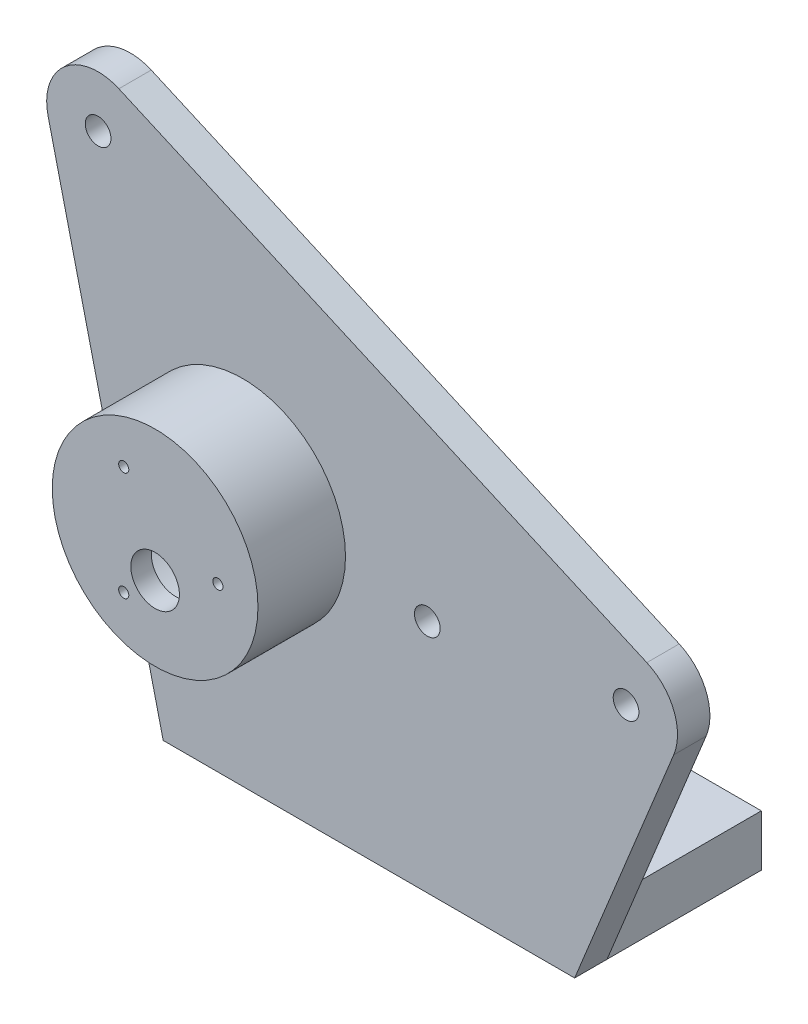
from build123d import *

# Parameters (mm, degrees)
SKETCH1_R           = 3.175
BOSS_EXTRUDE1_DEPTH = 4
SKETCH3_W           = 101.6
SKETCH3_H           = 12.7
BOSS_EXTRUDE3_DEPTH = 38.1
SKETCH4_R           = 3.175
SKETCH4_R_2         = 20.32
CUT_EXTRUDE1_DEPTH  = 8
SKETCH5_R           = 25.4
SKETCH5_R_2         = 20.32
BOSS_EXTRUDE4_DEPTH = 16.533800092
SKETCH6_R           = 25.4
SKETCH6_R_2         = 1.25
SKETCH6_R_3         = 6
BOSS_EXTRUDE5_DEPTH = 5.08
SKETCH7_R           = 2.54
CUT_EXTRUDE2_DEPTH  = 12.7


with BuildPart() as part:
    # Sketch1 → Boss-Extrude1 (new, symmetric)
    with BuildSketch(Plane.XY):
        with BuildLine():
            Line((5.127066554, 11.619087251), (-125.251133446, 69.150087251))
            ThreePointArc((-125.251133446, 69.150087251), (-138.50687017, 67.288803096), (-142.732372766, 54.587462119))
            Line((-142.732372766, 54.587462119), (-114.3, -64.7446))
            Line((-114.3, -64.7446), (-12.7, -64.7446))
            Line((-12.7, -64.7446), (11.7588969, -4.797743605))
            ThreePointArc((11.7588969, -4.797743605), (11.775484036, 4.756887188), (5.127066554, 11.619087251))
        make_face()
        with Locations((-130.3782, 57.531)):
            Circle(SKETCH1_R, mode=Mode.SUBTRACT)
        Circle(SKETCH1_R, mode=Mode.SUBTRACT)
    extrude(amount=BOSS_EXTRUDE1_DEPTH, both=True)

    # Sketch3 → Boss-Extrude3 (add)
    with BuildSketch(Plane(origin=(0, 0, -4), x_dir=(-1, 0, 0), z_dir=(0, 0, -1))):
        with Locations((63.5, -58.3946)):
            Rectangle(SKETCH3_W, SKETCH3_H)
    extrude(amount=BOSS_EXTRUDE3_DEPTH)

    # Sketch4 → Cut-Extrude1 (cut)
    with BuildSketch(Plane(origin=(0, 0, -4), x_dir=(-1, 0, 0), z_dir=(0, 0, -1))):
        with Locations((49.081699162, -6.648887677)):
            Circle(SKETCH4_R)
        with Locations((94.685151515, -2.911330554)):
            Circle(SKETCH4_R_2)
    extrude(amount=-CUT_EXTRUDE1_DEPTH, mode=Mode.SUBTRACT)

    # Sketch5 → Boss-Extrude4 (add)
    with BuildSketch(Plane.XY.offset(4)):
        with Locations(Location((-94.685151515, -2.911330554, 0), (0, 0, 180))):
            Circle(SKETCH5_R)
        with Locations(Location((-94.685151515, -2.911330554, 0), (0, 0, 180))):
            Circle(SKETCH5_R_2, mode=Mode.SUBTRACT)
    extrude(amount=BOSS_EXTRUDE4_DEPTH)

    # Sketch6 → Boss-Extrude5 (add)
    with BuildSketch(Plane.XY.offset(20.533800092)):
        with Locations((-94.685151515, -2.911330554)):
            Circle(SKETCH6_R)
        with Locations((-102.435151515, -16.334724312)):
            Circle(SKETCH6_R_2, mode=Mode.SUBTRACT)
        with Locations((-102.435151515, 10.512063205)):
            Circle(SKETCH6_R_2, mode=Mode.SUBTRACT)
        with Locations((-79.185151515, -2.911330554)):
            Circle(SKETCH6_R_2, mode=Mode.SUBTRACT)
        with Locations((-94.685151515, -9.911330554)):
            Circle(SKETCH6_R_3, mode=Mode.SUBTRACT)
    extrude(amount=BOSS_EXTRUDE5_DEPTH)

    # Sketch7 → Cut-Extrude2 (cut)
    with BuildSketch(Plane.XZ.offset(64.7446)):
        with Locations((-19.304, -8.572)):
            Circle(SKETCH7_R)
        with Locations((-44.196, -33.464)):
            Circle(SKETCH7_R)
    extrude(amount=-CUT_EXTRUDE2_DEPTH, mode=Mode.SUBTRACT)


solid = part.part
